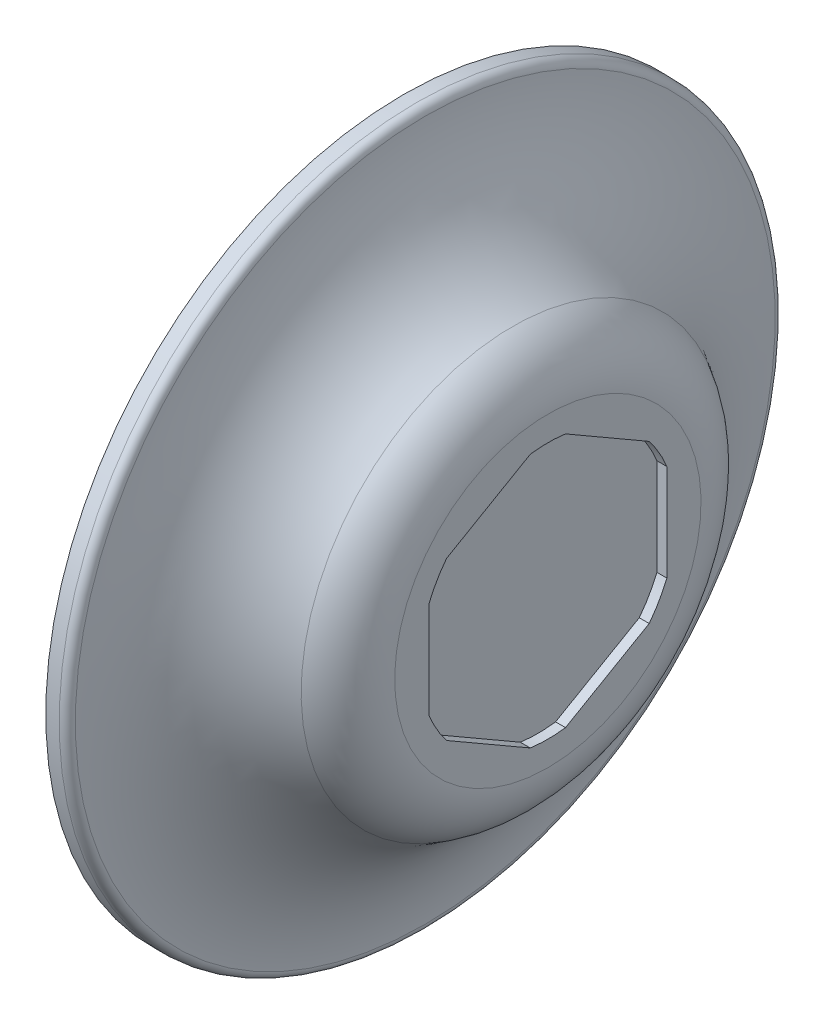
ISO-10303-21;
HEADER;
FILE_DESCRIPTION(('STEP AP214'),'2;1');
FILE_NAME('part.step','',(''),(''),'','','');
FILE_SCHEMA(('AUTOMOTIVE_DESIGN { 1 0 10303 214 1 1 1 1 }'));
ENDSEC;
DATA;
#1=APPLICATION_CONTEXT('core data for automotive mechanical design processes');
#2=APPLICATION_PROTOCOL_DEFINITION('international standard','automotive_design',2000,#1);
#3=PRODUCT_CONTEXT('',#1,'mechanical');
#4=PRODUCT('Part','Part','',(#3));
#5=PRODUCT_RELATED_PRODUCT_CATEGORY('part','',(#4));
#6=PRODUCT_DEFINITION_FORMATION('','',#4);
#7=PRODUCT_DEFINITION_CONTEXT('part definition',#1,'design');
#8=PRODUCT_DEFINITION('design','',#6,#7);
#9=PRODUCT_DEFINITION_SHAPE('','',#8);
#10=(LENGTH_UNIT() NAMED_UNIT(*) SI_UNIT(.MILLI.,.METRE.));
#11=(NAMED_UNIT(*) PLANE_ANGLE_UNIT() SI_UNIT($,.RADIAN.));
#12=(NAMED_UNIT(*) SI_UNIT($,.STERADIAN.) SOLID_ANGLE_UNIT());
#13=UNCERTAINTY_MEASURE_WITH_UNIT(LENGTH_MEASURE(1.E-05),#10,'distance_accuracy_value','');
#14=(GEOMETRIC_REPRESENTATION_CONTEXT(3) GLOBAL_UNCERTAINTY_ASSIGNED_CONTEXT((#13)) GLOBAL_UNIT_ASSIGNED_CONTEXT((#10,
#11,#12)) REPRESENTATION_CONTEXT('',''));
#15=CARTESIAN_POINT('',(0.,0.,0.));
#16=DIRECTION('',(0.,0.,1.));
#17=DIRECTION('',(1.,0.,0.));
#18=AXIS2_PLACEMENT_3D('',#15,#16,#17);
#19=CARTESIAN_POINT('',(6.94943478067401,0.,0.));
#20=DIRECTION('',(-1.,0.,0.));
#21=DIRECTION('',(0.,-1.,0.));
#22=AXIS2_PLACEMENT_3D('',#19,#20,#21);
#23=PLANE('',#22);
#24=CARTESIAN_POINT('',(6.94943478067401,0.,0.));
#25=DIRECTION('',(-1.,0.,0.));
#26=DIRECTION('',(0.,-1.,0.));
#27=AXIS2_PLACEMENT_3D('',#24,#25,#26);
#28=CIRCLE('',#27,12.2555);
#29=CARTESIAN_POINT('',(6.94943478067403,-12.2555,0.));
#30=VERTEX_POINT('',#29);
#31=EDGE_CURVE('E264',#30,#30,#28,.T.);
#32=ORIENTED_EDGE('',*,*,#31,.F.);
#33=EDGE_LOOP('',(#32));
#34=FACE_BOUND('',#33,.T.);
#35=CARTESIAN_POINT('',(6.94943478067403,0.,0.));
#36=DIRECTION('',(-1.,0.,0.));
#37=DIRECTION('',(0.,-1.,0.));
#38=AXIS2_PLACEMENT_3D('',#35,#36,#37);
#39=CIRCLE('',#38,15.5980272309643);
#40=CARTESIAN_POINT('',(6.94943478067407,-15.5980272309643,0.));
#41=VERTEX_POINT('',#40);
#42=EDGE_CURVE('E199',#41,#41,#39,.T.);
#43=ORIENTED_EDGE('',*,*,#42,.T.);
#44=EDGE_LOOP('',(#43));
#45=FACE_BOUND('',#44,.T.);
#46=ADVANCED_FACE('F28',(#34,#45),#23,.T.);
#47=CARTESIAN_POINT('',(9.413234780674,0.,0.));
#48=DIRECTION('',(-1.,0.,0.));
#49=DIRECTION('',(0.,-1.,0.));
#50=AXIS2_PLACEMENT_3D('',#47,#48,#49);
#51=PLANE('',#50);
#52=DIRECTION('',(0.,-0.500000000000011,-0.866025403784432));
#53=VECTOR('',#52,1.);
#54=CARTESIAN_POINT('',(9.41323478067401,-6.04451244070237,7.76779734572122));
#55=LINE('',#54,#53);
#56=CARTESIAN_POINT('',(9.41323478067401,-6.04451244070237,7.76779734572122));
#57=VERTEX_POINT('',#56);
#58=CARTESIAN_POINT('',(9.41323478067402,-9.74936605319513,1.35080265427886));
#59=VERTEX_POINT('',#58);
#60=EDGE_CURVE('E132',#57,#59,#55,.T.);
#61=ORIENTED_EDGE('',*,*,#60,.F.);
#62=CARTESIAN_POINT('',(9.413234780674,0.,0.));
#63=DIRECTION('',(1.,0.,0.));
#64=DIRECTION('',(0.,1.,0.));
#65=AXIS2_PLACEMENT_3D('',#62,#63,#64);
#66=CIRCLE('',#65,9.84249999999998);
#67=CARTESIAN_POINT('',(9.41323478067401,-3.70485361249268,9.1186));
#68=VERTEX_POINT('',#67);
#69=EDGE_CURVE('E42',#68,#57,#66,.T.);
#70=ORIENTED_EDGE('',*,*,#69,.F.);
#71=DIRECTION('',(0.,-1.,0.));
#72=VECTOR('',#71,1.);
#73=CARTESIAN_POINT('',(9.41323478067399,3.70485361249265,9.1186));
#74=LINE('',#73,#72);
#75=CARTESIAN_POINT('',(9.41323478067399,3.70485361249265,9.1186));
#76=VERTEX_POINT('',#75);
#77=EDGE_CURVE('E166',#76,#68,#74,.T.);
#78=ORIENTED_EDGE('',*,*,#77,.F.);
#79=CARTESIAN_POINT('',(9.413234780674,0.,0.));
#80=DIRECTION('',(1.,0.,0.));
#81=DIRECTION('',(0.,1.,0.));
#82=AXIS2_PLACEMENT_3D('',#79,#80,#81);
#83=CIRCLE('',#82,9.8425);
#84=CARTESIAN_POINT('',(9.41323478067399,6.04451244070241,7.76779734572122));
#85=VERTEX_POINT('',#84);
#86=EDGE_CURVE('E163',#85,#76,#83,.T.);
#87=ORIENTED_EDGE('',*,*,#86,.F.);
#88=DIRECTION('',(0.,0.499999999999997,-0.86602540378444));
#89=VECTOR('',#88,1.);
#90=CARTESIAN_POINT('',(9.41323478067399,6.04451244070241,7.76779734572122));
#91=LINE('',#90,#89);
#92=CARTESIAN_POINT('',(9.41323478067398,9.74936605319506,1.3508026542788));
#93=VERTEX_POINT('',#92);
#94=EDGE_CURVE('E160',#85,#93,#91,.T.);
#95=ORIENTED_EDGE('',*,*,#94,.T.);
#96=CARTESIAN_POINT('',(9.413234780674,0.,0.));
#97=DIRECTION('',(1.,0.,0.));
#98=DIRECTION('',(0.,1.,0.));
#99=AXIS2_PLACEMENT_3D('',#96,#97,#98);
#100=CIRCLE('',#99,9.84249999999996);
#101=CARTESIAN_POINT('',(9.41323478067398,9.74936605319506,-1.3508026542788));
#102=VERTEX_POINT('',#101);
#103=EDGE_CURVE('E157',#102,#93,#100,.T.);
#104=ORIENTED_EDGE('',*,*,#103,.F.);
#105=DIRECTION('',(0.,-0.499999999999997,-0.86602540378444));
#106=VECTOR('',#105,1.);
#107=CARTESIAN_POINT('',(9.41323478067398,9.74936605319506,-1.3508026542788));
#108=LINE('',#107,#106);
#109=CARTESIAN_POINT('',(9.41323478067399,6.04451244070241,-7.76779734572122));
#110=VERTEX_POINT('',#109);
#111=EDGE_CURVE('E154',#102,#110,#108,.T.);
#112=ORIENTED_EDGE('',*,*,#111,.T.);
#113=CARTESIAN_POINT('',(9.413234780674,0.,0.));
#114=DIRECTION('',(1.,0.,0.));
#115=DIRECTION('',(0.,1.,0.));
#116=AXIS2_PLACEMENT_3D('',#113,#114,#115);
#117=CIRCLE('',#116,9.8425);
#118=CARTESIAN_POINT('',(9.41323478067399,3.70485361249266,-9.1186));
#119=VERTEX_POINT('',#118);
#120=EDGE_CURVE('E151',#119,#110,#117,.T.);
#121=ORIENTED_EDGE('',*,*,#120,.F.);
#122=DIRECTION('',(0.,-1.,0.));
#123=VECTOR('',#122,1.);
#124=CARTESIAN_POINT('',(9.41323478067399,3.70485361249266,-9.1186));
#125=LINE('',#124,#123);
#126=CARTESIAN_POINT('',(9.41323478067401,-3.70485361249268,-9.11859999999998));
#127=VERTEX_POINT('',#126);
#128=EDGE_CURVE('E148',#119,#127,#125,.T.);
#129=ORIENTED_EDGE('',*,*,#128,.T.);
#130=CARTESIAN_POINT('',(9.413234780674,0.,0.));
#131=DIRECTION('',(1.,0.,0.));
#132=DIRECTION('',(0.,1.,0.));
#133=AXIS2_PLACEMENT_3D('',#130,#131,#132);
#134=CIRCLE('',#133,9.84249999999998);
#135=CARTESIAN_POINT('',(9.41323478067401,-6.04451244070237,-7.76779734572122));
#136=VERTEX_POINT('',#135);
#137=EDGE_CURVE('E142',#136,#127,#134,.T.);
#138=ORIENTED_EDGE('',*,*,#137,.F.);
#139=DIRECTION('',(0.,0.500000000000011,-0.866025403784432));
#140=VECTOR('',#139,1.);
#141=CARTESIAN_POINT('',(9.41323478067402,-9.74936605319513,-1.35080265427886));
#142=LINE('',#141,#140);
#143=CARTESIAN_POINT('',(9.41323478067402,-9.74936605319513,-1.35080265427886));
#144=VERTEX_POINT('',#143);
#145=EDGE_CURVE('E140',#144,#136,#142,.T.);
#146=ORIENTED_EDGE('',*,*,#145,.F.);
#147=CARTESIAN_POINT('',(9.413234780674,0.,0.));
#148=DIRECTION('',(1.,0.,0.));
#149=DIRECTION('',(0.,1.,0.));
#150=AXIS2_PLACEMENT_3D('',#147,#148,#149);
#151=CIRCLE('',#150,9.8425);
#152=EDGE_CURVE('E121',#59,#144,#151,.T.);
#153=ORIENTED_EDGE('',*,*,#152,.F.);
#154=EDGE_LOOP('',(#61,#70,#78,#87,#95,#104,#112,#121,#129,#138,#146,#153));
#155=FACE_BOUND('',#154,.T.);
#156=CARTESIAN_POINT('',(9.41323478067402,0.,0.));
#157=DIRECTION('',(-1.,0.,0.));
#158=DIRECTION('',(0.,-1.,0.));
#159=AXIS2_PLACEMENT_3D('',#156,#157,#158);
#160=CIRCLE('',#159,11.7436081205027);
#161=CARTESIAN_POINT('',(9.41323478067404,-11.7436081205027,0.));
#162=VERTEX_POINT('',#161);
#163=EDGE_CURVE('E232',#162,#162,#160,.T.);
#164=ORIENTED_EDGE('',*,*,#163,.F.);
#165=EDGE_LOOP('',(#164));
#166=FACE_BOUND('',#165,.T.);
#167=ADVANCED_FACE('F136',(#155,#166),#51,.F.);
#168=CARTESIAN_POINT('',(4.33323478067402,0.,0.));
#169=DIRECTION('',(-1.,0.,0.));
#170=DIRECTION('',(0.,-1.,0.));
#171=AXIS2_PLACEMENT_3D('',#168,#169,#170);
#172=TOROIDAL_SURFACE('',#171,11.7436081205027,5.08);
#173=CARTESIAN_POINT('',(6.7237391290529,0.,0.));
#174=DIRECTION('',(-1.,0.,0.));
#175=DIRECTION('',(0.,-1.,0.));
#176=AXIS2_PLACEMENT_3D('',#173,#174,#175);
#177=CIRCLE('',#176,16.2260058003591);
#178=CARTESIAN_POINT('',(6.72373912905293,-16.2260058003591,0.));
#179=VERTEX_POINT('',#178);
#180=EDGE_CURVE('E229',#179,#179,#177,.T.);
#181=ORIENTED_EDGE('',*,*,#180,.F.);
#182=EDGE_LOOP('',(#181));
#183=FACE_BOUND('',#182,.T.);
#184=ORIENTED_EDGE('',*,*,#163,.T.);
#185=EDGE_LOOP('',(#184));
#186=FACE_BOUND('',#185,.T.);
#187=ADVANCED_FACE('F260',(#183,#186),#172,.T.);
#188=CARTESIAN_POINT('',(12.7000000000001,0.,0.));
#189=DIRECTION('',(-1.,0.,0.));
#190=DIRECTION('',(0.,-1.,0.));
#191=AXIS2_PLACEMENT_3D('',#188,#189,#190);
#192=TOROIDAL_SURFACE('',#191,27.432,12.7);
#193=CARTESIAN_POINT('',(0.0144072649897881,0.,0.));
#194=DIRECTION('',(1.,0.,0.));
#195=DIRECTION('',(0.,1.,0.));
#196=AXIS2_PLACEMENT_3D('',#193,#194,#195);
#197=CIRCLE('',#196,26.8272380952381);
#198=CARTESIAN_POINT('',(0.0144072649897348,26.8272380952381,0.));
#199=VERTEX_POINT('',#198);
#200=EDGE_CURVE('E11',#199,#199,#197,.T.);
#201=ORIENTED_EDGE('',*,*,#200,.T.);
#202=EDGE_LOOP('',(#201));
#203=FACE_BOUND('',#202,.T.);
#204=ORIENTED_EDGE('',*,*,#180,.T.);
#205=EDGE_LOOP('',(#204));
#206=FACE_BOUND('',#205,.T.);
#207=ADVANCED_FACE('F285',(#203,#206),#192,.F.);
#208=CARTESIAN_POINT('',(6.94943478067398,0.,0.));
#209=DIRECTION('',(-1.,0.,0.));
#210=DIRECTION('',(0.,-1.,0.));
#211=AXIS2_PLACEMENT_3D('',#208,#209,#210);
#212=CYLINDRICAL_SURFACE('',#211,27.432);
#213=CARTESIAN_POINT('',(-0.619872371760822,0.,0.));
#214=DIRECTION('',(1.,0.,0.));
#215=DIRECTION('',(0.,1.,0.));
#216=AXIS2_PLACEMENT_3D('',#213,#214,#215);
#217=CIRCLE('',#216,27.432);
#218=CARTESIAN_POINT('',(-0.619872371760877,27.432,0.));
#219=VERTEX_POINT('',#218);
#220=EDGE_CURVE('E35',#219,#219,#217,.F.);
#221=ORIENTED_EDGE('',*,*,#220,.T.);
#222=EDGE_LOOP('',(#221));
#223=FACE_BOUND('',#222,.T.);
#224=CARTESIAN_POINT('',(-1.6509999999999,0.,0.));
#225=DIRECTION('',(-1.,0.,0.));
#226=DIRECTION('',(0.,-1.,0.));
#227=AXIS2_PLACEMENT_3D('',#224,#225,#226);
#228=CIRCLE('',#227,27.432);
#229=CARTESIAN_POINT('',(-1.65099999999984,-27.4320000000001,0.));
#230=VERTEX_POINT('',#229);
#231=EDGE_CURVE('E226',#230,#230,#228,.T.);
#232=ORIENTED_EDGE('',*,*,#231,.F.);
#233=EDGE_LOOP('',(#232));
#234=FACE_BOUND('',#233,.T.);
#235=ADVANCED_FACE('F237',(#223,#234),#212,.T.);
#236=CARTESIAN_POINT('',(-1.65099999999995,27.432,0.));
#237=DIRECTION('',(1.,0.,0.));
#238=DIRECTION('',(0.,1.,0.));
#239=AXIS2_PLACEMENT_3D('',#236,#237,#238);
#240=PLANE('',#239);
#241=CARTESIAN_POINT('',(-1.6509999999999,0.,0.));
#242=DIRECTION('',(-1.,0.,0.));
#243=DIRECTION('',(0.,-1.,0.));
#244=AXIS2_PLACEMENT_3D('',#241,#242,#243);
#245=CIRCLE('',#244,26.162);
#246=CARTESIAN_POINT('',(-1.65099999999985,-26.1620000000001,0.));
#247=VERTEX_POINT('',#246);
#248=EDGE_CURVE('E223',#247,#247,#245,.T.);
#249=ORIENTED_EDGE('',*,*,#248,.F.);
#250=EDGE_LOOP('',(#249));
#251=FACE_BOUND('',#250,.T.);
#252=ORIENTED_EDGE('',*,*,#231,.T.);
#253=EDGE_LOOP('',(#252));
#254=FACE_BOUND('',#253,.T.);
#255=ADVANCED_FACE('F277',(#251,#254),#240,.F.);
#256=CARTESIAN_POINT('',(6.94943478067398,0.,0.));
#257=DIRECTION('',(-1.,0.,0.));
#258=DIRECTION('',(0.,-1.,0.));
#259=AXIS2_PLACEMENT_3D('',#256,#257,#258);
#260=CYLINDRICAL_SURFACE('',#259,26.162);
#261=CARTESIAN_POINT('',(-0.395763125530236,0.,0.));
#262=DIRECTION('',(-1.,0.,0.));
#263=DIRECTION('',(0.,-1.,0.));
#264=AXIS2_PLACEMENT_3D('',#261,#262,#263);
#265=CIRCLE('',#264,26.162);
#266=CARTESIAN_POINT('',(-0.395763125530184,-26.1620000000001,0.));
#267=VERTEX_POINT('',#266);
#268=EDGE_CURVE('E220',#267,#267,#265,.T.);
#269=ORIENTED_EDGE('',*,*,#268,.F.);
#270=EDGE_LOOP('',(#269));
#271=FACE_BOUND('',#270,.T.);
#272=ORIENTED_EDGE('',*,*,#248,.T.);
#273=EDGE_LOOP('',(#272));
#274=FACE_BOUND('',#273,.T.);
#275=ADVANCED_FACE('F271',(#271,#274),#260,.F.);
#276=CARTESIAN_POINT('',(12.7000000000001,0.,0.));
#277=DIRECTION('',(-1.,0.,0.));
#278=DIRECTION('',(0.,-1.,0.));
#279=AXIS2_PLACEMENT_3D('',#276,#277,#278);
#280=TOROIDAL_SURFACE('',#279,27.432,13.1572);
#281=ORIENTED_EDGE('',*,*,#42,.F.);
#282=EDGE_LOOP('',(#281));
#283=FACE_BOUND('',#282,.T.);
#284=ORIENTED_EDGE('',*,*,#268,.T.);
#285=EDGE_LOOP('',(#284));
#286=FACE_BOUND('',#285,.T.);
#287=ADVANCED_FACE('F267',(#283,#286),#280,.T.);
#288=CARTESIAN_POINT('',(8.651234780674,0.,0.));
#289=DIRECTION('',(1.,0.,0.));
#290=DIRECTION('',(0.,1.,0.));
#291=AXIS2_PLACEMENT_3D('',#288,#289,#290);
#292=CYLINDRICAL_SURFACE('',#291,9.84249999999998);
#293=ORIENTED_EDGE('',*,*,#69,.T.);
#294=DIRECTION('',(1.,0.,0.));
#295=VECTOR('',#294,1.);
#296=CARTESIAN_POINT('',(8.65123478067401,-6.04451244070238,7.76779734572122));
#297=LINE('',#296,#295);
#298=CARTESIAN_POINT('',(8.65123478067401,-6.04451244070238,7.76779734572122));
#299=VERTEX_POINT('',#298);
#300=EDGE_CURVE('E129',#299,#57,#297,.T.);
#301=ORIENTED_EDGE('',*,*,#300,.F.);
#302=CARTESIAN_POINT('',(8.651234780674,0.,0.));
#303=DIRECTION('',(1.,0.,0.));
#304=DIRECTION('',(0.,1.,0.));
#305=AXIS2_PLACEMENT_3D('',#302,#303,#304);
#306=CIRCLE('',#305,9.84249999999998);
#307=CARTESIAN_POINT('',(8.65123478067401,-3.70485361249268,9.1186));
#308=VERTEX_POINT('',#307);
#309=EDGE_CURVE('E168',#308,#299,#306,.T.);
#310=ORIENTED_EDGE('',*,*,#309,.F.);
#311=DIRECTION('',(1.,0.,0.));
#312=VECTOR('',#311,1.);
#313=CARTESIAN_POINT('',(8.65123478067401,-3.70485361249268,9.1186));
#314=LINE('',#313,#312);
#315=EDGE_CURVE('E49',#308,#68,#314,.T.);
#316=ORIENTED_EDGE('',*,*,#315,.T.);
#317=EDGE_LOOP('',(#293,#301,#310,#316));
#318=FACE_BOUND('',#317,.T.);
#319=ADVANCED_FACE('F270',(#318),#292,.F.);
#320=CARTESIAN_POINT('',(8.65123478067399,3.70485361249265,9.1186));
#321=DIRECTION('',(0.,0.,1.));
#322=DIRECTION('',(1.,0.,0.));
#323=AXIS2_PLACEMENT_3D('',#320,#321,#322);
#324=PLANE('',#323);
#325=ORIENTED_EDGE('',*,*,#77,.T.);
#326=ORIENTED_EDGE('',*,*,#315,.F.);
#327=DIRECTION('',(0.,-1.,0.));
#328=VECTOR('',#327,1.);
#329=CARTESIAN_POINT('',(8.65123478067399,3.70485361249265,9.1186));
#330=LINE('',#329,#328);
#331=CARTESIAN_POINT('',(8.65123478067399,3.70485361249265,9.1186));
#332=VERTEX_POINT('',#331);
#333=EDGE_CURVE('E195',#332,#308,#330,.T.);
#334=ORIENTED_EDGE('',*,*,#333,.F.);
#335=DIRECTION('',(1.,0.,0.));
#336=VECTOR('',#335,1.);
#337=CARTESIAN_POINT('',(8.65123478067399,3.70485361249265,9.1186));
#338=LINE('',#337,#336);
#339=EDGE_CURVE('E200',#332,#76,#338,.T.);
#340=ORIENTED_EDGE('',*,*,#339,.T.);
#341=EDGE_LOOP('',(#325,#326,#334,#340));
#342=FACE_BOUND('',#341,.T.);
#343=ADVANCED_FACE('F324',(#342),#324,.F.);
#344=CARTESIAN_POINT('',(8.651234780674,0.,0.));
#345=DIRECTION('',(1.,0.,0.));
#346=DIRECTION('',(0.,1.,0.));
#347=AXIS2_PLACEMENT_3D('',#344,#345,#346);
#348=CYLINDRICAL_SURFACE('',#347,9.8425);
#349=ORIENTED_EDGE('',*,*,#86,.T.);
#350=ORIENTED_EDGE('',*,*,#339,.F.);
#351=CARTESIAN_POINT('',(8.651234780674,0.,0.));
#352=DIRECTION('',(1.,0.,0.));
#353=DIRECTION('',(0.,1.,0.));
#354=AXIS2_PLACEMENT_3D('',#351,#352,#353);
#355=CIRCLE('',#354,9.8425);
#356=CARTESIAN_POINT('',(8.65123478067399,6.04451244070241,7.76779734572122));
#357=VERTEX_POINT('',#356);
#358=EDGE_CURVE('E192',#357,#332,#355,.T.);
#359=ORIENTED_EDGE('',*,*,#358,.F.);
#360=DIRECTION('',(1.,0.,0.));
#361=VECTOR('',#360,1.);
#362=CARTESIAN_POINT('',(8.65123478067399,6.04451244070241,7.76779734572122));
#363=LINE('',#362,#361);
#364=EDGE_CURVE('E202',#357,#85,#363,.T.);
#365=ORIENTED_EDGE('',*,*,#364,.T.);
#366=EDGE_LOOP('',(#349,#350,#359,#365));
#367=FACE_BOUND('',#366,.T.);
#368=ADVANCED_FACE('F331',(#367),#348,.F.);
#369=CARTESIAN_POINT('',(8.65123478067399,6.04451244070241,7.76779734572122));
#370=DIRECTION('',(0.,-0.86602540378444,-0.499999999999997));
#371=DIRECTION('',(0.,0.499999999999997,-0.86602540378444));
#372=AXIS2_PLACEMENT_3D('',#369,#370,#371);
#373=PLANE('',#372);
#374=ORIENTED_EDGE('',*,*,#94,.F.);
#375=ORIENTED_EDGE('',*,*,#364,.F.);
#376=DIRECTION('',(0.,0.499999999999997,-0.86602540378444));
#377=VECTOR('',#376,1.);
#378=CARTESIAN_POINT('',(8.65123478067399,6.04451244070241,7.76779734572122));
#379=LINE('',#378,#377);
#380=CARTESIAN_POINT('',(8.65123478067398,9.74936605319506,1.3508026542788));
#381=VERTEX_POINT('',#380);
#382=EDGE_CURVE('E190',#357,#381,#379,.T.);
#383=ORIENTED_EDGE('',*,*,#382,.T.);
#384=DIRECTION('',(1.,0.,0.));
#385=VECTOR('',#384,1.);
#386=CARTESIAN_POINT('',(8.65123478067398,9.74936605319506,1.3508026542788));
#387=LINE('',#386,#385);
#388=EDGE_CURVE('E204',#381,#93,#387,.T.);
#389=ORIENTED_EDGE('',*,*,#388,.T.);
#390=EDGE_LOOP('',(#374,#375,#383,#389));
#391=FACE_BOUND('',#390,.T.);
#392=ADVANCED_FACE('F338',(#391),#373,.T.);
#393=CARTESIAN_POINT('',(8.651234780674,0.,0.));
#394=DIRECTION('',(1.,0.,0.));
#395=DIRECTION('',(0.,1.,0.));
#396=AXIS2_PLACEMENT_3D('',#393,#394,#395);
#397=CYLINDRICAL_SURFACE('',#396,9.84249999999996);
#398=ORIENTED_EDGE('',*,*,#103,.T.);
#399=ORIENTED_EDGE('',*,*,#388,.F.);
#400=CARTESIAN_POINT('',(8.651234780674,0.,0.));
#401=DIRECTION('',(1.,0.,0.));
#402=DIRECTION('',(0.,1.,0.));
#403=AXIS2_PLACEMENT_3D('',#400,#401,#402);
#404=CIRCLE('',#403,9.84249999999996);
#405=CARTESIAN_POINT('',(8.65123478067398,9.74936605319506,-1.3508026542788));
#406=VERTEX_POINT('',#405);
#407=EDGE_CURVE('E187',#406,#381,#404,.T.);
#408=ORIENTED_EDGE('',*,*,#407,.F.);
#409=DIRECTION('',(1.,0.,0.));
#410=VECTOR('',#409,1.);
#411=CARTESIAN_POINT('',(8.65123478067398,9.74936605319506,-1.3508026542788));
#412=LINE('',#411,#410);
#413=EDGE_CURVE('E206',#406,#102,#412,.T.);
#414=ORIENTED_EDGE('',*,*,#413,.T.);
#415=EDGE_LOOP('',(#398,#399,#408,#414));
#416=FACE_BOUND('',#415,.T.);
#417=ADVANCED_FACE('F346',(#416),#397,.F.);
#418=CARTESIAN_POINT('',(8.65123478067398,9.74936605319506,-1.3508026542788));
#419=DIRECTION('',(0.,-0.86602540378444,0.499999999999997));
#420=DIRECTION('',(0.,-0.499999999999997,-0.86602540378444));
#421=AXIS2_PLACEMENT_3D('',#418,#419,#420);
#422=PLANE('',#421);
#423=ORIENTED_EDGE('',*,*,#111,.F.);
#424=ORIENTED_EDGE('',*,*,#413,.F.);
#425=DIRECTION('',(0.,-0.499999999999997,-0.86602540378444));
#426=VECTOR('',#425,1.);
#427=CARTESIAN_POINT('',(8.65123478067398,9.74936605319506,-1.3508026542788));
#428=LINE('',#427,#426);
#429=CARTESIAN_POINT('',(8.65123478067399,6.04451244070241,-7.76779734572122));
#430=VERTEX_POINT('',#429);
#431=EDGE_CURVE('E185',#406,#430,#428,.T.);
#432=ORIENTED_EDGE('',*,*,#431,.T.);
#433=DIRECTION('',(1.,0.,0.));
#434=VECTOR('',#433,1.);
#435=CARTESIAN_POINT('',(8.65123478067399,6.04451244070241,-7.76779734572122));
#436=LINE('',#435,#434);
#437=EDGE_CURVE('E208',#430,#110,#436,.T.);
#438=ORIENTED_EDGE('',*,*,#437,.T.);
#439=EDGE_LOOP('',(#423,#424,#432,#438));
#440=FACE_BOUND('',#439,.T.);
#441=ADVANCED_FACE('F354',(#440),#422,.T.);
#442=CARTESIAN_POINT('',(8.651234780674,0.,0.));
#443=DIRECTION('',(1.,0.,0.));
#444=DIRECTION('',(0.,1.,0.));
#445=AXIS2_PLACEMENT_3D('',#442,#443,#444);
#446=CYLINDRICAL_SURFACE('',#445,9.8425);
#447=ORIENTED_EDGE('',*,*,#120,.T.);
#448=ORIENTED_EDGE('',*,*,#437,.F.);
#449=CARTESIAN_POINT('',(8.651234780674,0.,0.));
#450=DIRECTION('',(1.,0.,0.));
#451=DIRECTION('',(0.,1.,0.));
#452=AXIS2_PLACEMENT_3D('',#449,#450,#451);
#453=CIRCLE('',#452,9.8425);
#454=CARTESIAN_POINT('',(8.65123478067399,3.70485361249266,-9.1186));
#455=VERTEX_POINT('',#454);
#456=EDGE_CURVE('E182',#455,#430,#453,.T.);
#457=ORIENTED_EDGE('',*,*,#456,.F.);
#458=DIRECTION('',(1.,0.,0.));
#459=VECTOR('',#458,1.);
#460=CARTESIAN_POINT('',(8.65123478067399,3.70485361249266,-9.1186));
#461=LINE('',#460,#459);
#462=EDGE_CURVE('E210',#455,#119,#461,.T.);
#463=ORIENTED_EDGE('',*,*,#462,.T.);
#464=EDGE_LOOP('',(#447,#448,#457,#463));
#465=FACE_BOUND('',#464,.T.);
#466=ADVANCED_FACE('F362',(#465),#446,.F.);
#467=CARTESIAN_POINT('',(8.65123478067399,3.70485361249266,-9.1186));
#468=DIRECTION('',(0.,0.,1.));
#469=DIRECTION('',(1.,0.,0.));
#470=AXIS2_PLACEMENT_3D('',#467,#468,#469);
#471=PLANE('',#470);
#472=ORIENTED_EDGE('',*,*,#128,.F.);
#473=ORIENTED_EDGE('',*,*,#462,.F.);
#474=DIRECTION('',(0.,-1.,0.));
#475=VECTOR('',#474,1.);
#476=CARTESIAN_POINT('',(8.65123478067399,3.70485361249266,-9.1186));
#477=LINE('',#476,#475);
#478=CARTESIAN_POINT('',(8.65123478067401,-3.70485361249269,-9.11859999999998));
#479=VERTEX_POINT('',#478);
#480=EDGE_CURVE('E180',#455,#479,#477,.T.);
#481=ORIENTED_EDGE('',*,*,#480,.T.);
#482=DIRECTION('',(1.,0.,0.));
#483=VECTOR('',#482,1.);
#484=CARTESIAN_POINT('',(8.65123478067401,-3.70485361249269,-9.11859999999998));
#485=LINE('',#484,#483);
#486=EDGE_CURVE('E212',#479,#127,#485,.T.);
#487=ORIENTED_EDGE('',*,*,#486,.T.);
#488=EDGE_LOOP('',(#472,#473,#481,#487));
#489=FACE_BOUND('',#488,.T.);
#490=ADVANCED_FACE('F370',(#489),#471,.T.);
#491=CARTESIAN_POINT('',(8.651234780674,0.,0.));
#492=DIRECTION('',(1.,0.,0.));
#493=DIRECTION('',(0.,1.,0.));
#494=AXIS2_PLACEMENT_3D('',#491,#492,#493);
#495=CYLINDRICAL_SURFACE('',#494,9.84249999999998);
#496=ORIENTED_EDGE('',*,*,#137,.T.);
#497=ORIENTED_EDGE('',*,*,#486,.F.);
#498=CARTESIAN_POINT('',(8.651234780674,0.,0.));
#499=DIRECTION('',(1.,0.,0.));
#500=DIRECTION('',(0.,1.,0.));
#501=AXIS2_PLACEMENT_3D('',#498,#499,#500);
#502=CIRCLE('',#501,9.84249999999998);
#503=CARTESIAN_POINT('',(8.65123478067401,-6.04451244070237,-7.76779734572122));
#504=VERTEX_POINT('',#503);
#505=EDGE_CURVE('E177',#504,#479,#502,.T.);
#506=ORIENTED_EDGE('',*,*,#505,.F.);
#507=DIRECTION('',(1.,0.,0.));
#508=VECTOR('',#507,1.);
#509=CARTESIAN_POINT('',(8.65123478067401,-6.04451244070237,-7.76779734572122));
#510=LINE('',#509,#508);
#511=EDGE_CURVE('E214',#504,#136,#510,.T.);
#512=ORIENTED_EDGE('',*,*,#511,.T.);
#513=EDGE_LOOP('',(#496,#497,#506,#512));
#514=FACE_BOUND('',#513,.T.);
#515=ADVANCED_FACE('F378',(#514),#495,.F.);
#516=CARTESIAN_POINT('',(8.65123478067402,-9.74936605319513,-1.35080265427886));
#517=DIRECTION('',(0.,-0.866025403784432,-0.500000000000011));
#518=DIRECTION('',(0.,0.500000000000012,-0.866025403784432));
#519=AXIS2_PLACEMENT_3D('',#516,#517,#518);
#520=PLANE('',#519);
#521=ORIENTED_EDGE('',*,*,#145,.T.);
#522=ORIENTED_EDGE('',*,*,#511,.F.);
#523=DIRECTION('',(0.,0.500000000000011,-0.866025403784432));
#524=VECTOR('',#523,1.);
#525=CARTESIAN_POINT('',(8.65123478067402,-9.74936605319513,-1.35080265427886));
#526=LINE('',#525,#524);
#527=CARTESIAN_POINT('',(8.65123478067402,-9.74936605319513,-1.35080265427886));
#528=VERTEX_POINT('',#527);
#529=EDGE_CURVE('E174',#528,#504,#526,.T.);
#530=ORIENTED_EDGE('',*,*,#529,.F.);
#531=DIRECTION('',(1.,0.,0.));
#532=VECTOR('',#531,1.);
#533=CARTESIAN_POINT('',(8.65123478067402,-9.74936605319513,-1.35080265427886));
#534=LINE('',#533,#532);
#535=EDGE_CURVE('E128',#528,#144,#534,.T.);
#536=ORIENTED_EDGE('',*,*,#535,.T.);
#537=EDGE_LOOP('',(#521,#522,#530,#536));
#538=FACE_BOUND('',#537,.T.);
#539=ADVANCED_FACE('F386',(#538),#520,.F.);
#540=CARTESIAN_POINT('',(8.651234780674,0.,0.));
#541=DIRECTION('',(1.,0.,0.));
#542=DIRECTION('',(0.,1.,0.));
#543=AXIS2_PLACEMENT_3D('',#540,#541,#542);
#544=CYLINDRICAL_SURFACE('',#543,9.8425);
#545=ORIENTED_EDGE('',*,*,#152,.T.);
#546=ORIENTED_EDGE('',*,*,#535,.F.);
#547=CARTESIAN_POINT('',(8.651234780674,0.,0.));
#548=DIRECTION('',(1.,0.,0.));
#549=DIRECTION('',(0.,1.,0.));
#550=AXIS2_PLACEMENT_3D('',#547,#548,#549);
#551=CIRCLE('',#550,9.8425);
#552=CARTESIAN_POINT('',(8.65123478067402,-9.74936605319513,1.35080265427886));
#553=VERTEX_POINT('',#552);
#554=EDGE_CURVE('E124',#553,#528,#551,.T.);
#555=ORIENTED_EDGE('',*,*,#554,.F.);
#556=DIRECTION('',(1.,0.,0.));
#557=VECTOR('',#556,1.);
#558=CARTESIAN_POINT('',(8.65123478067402,-9.74936605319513,1.35080265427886));
#559=LINE('',#558,#557);
#560=EDGE_CURVE('E117',#553,#59,#559,.T.);
#561=ORIENTED_EDGE('',*,*,#560,.T.);
#562=EDGE_LOOP('',(#545,#546,#555,#561));
#563=FACE_BOUND('',#562,.T.);
#564=ADVANCED_FACE('F119',(#563),#544,.F.);
#565=CARTESIAN_POINT('',(8.65123478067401,-6.04451244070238,7.76779734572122));
#566=DIRECTION('',(0.,-0.866025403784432,0.500000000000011));
#567=DIRECTION('',(0.,-0.500000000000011,-0.866025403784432));
#568=AXIS2_PLACEMENT_3D('',#565,#566,#567);
#569=PLANE('',#568);
#570=ORIENTED_EDGE('',*,*,#60,.T.);
#571=ORIENTED_EDGE('',*,*,#560,.F.);
#572=DIRECTION('',(0.,-0.500000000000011,-0.866025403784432));
#573=VECTOR('',#572,1.);
#574=CARTESIAN_POINT('',(8.65123478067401,-6.04451244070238,7.76779734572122));
#575=LINE('',#574,#573);
#576=EDGE_CURVE('E171',#299,#553,#575,.T.);
#577=ORIENTED_EDGE('',*,*,#576,.F.);
#578=ORIENTED_EDGE('',*,*,#300,.T.);
#579=EDGE_LOOP('',(#570,#571,#577,#578));
#580=FACE_BOUND('',#579,.T.);
#581=ADVANCED_FACE('F133',(#580),#569,.F.);
#582=CARTESIAN_POINT('',(8.651234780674,0.,0.));
#583=DIRECTION('',(1.,0.,0.));
#584=DIRECTION('',(0.,1.,0.));
#585=AXIS2_PLACEMENT_3D('',#582,#583,#584);
#586=PLANE('',#585);
#587=ORIENTED_EDGE('',*,*,#309,.T.);
#588=ORIENTED_EDGE('',*,*,#576,.T.);
#589=ORIENTED_EDGE('',*,*,#554,.T.);
#590=ORIENTED_EDGE('',*,*,#529,.T.);
#591=ORIENTED_EDGE('',*,*,#505,.T.);
#592=ORIENTED_EDGE('',*,*,#480,.F.);
#593=ORIENTED_EDGE('',*,*,#456,.T.);
#594=ORIENTED_EDGE('',*,*,#431,.F.);
#595=ORIENTED_EDGE('',*,*,#407,.T.);
#596=ORIENTED_EDGE('',*,*,#382,.F.);
#597=ORIENTED_EDGE('',*,*,#358,.T.);
#598=ORIENTED_EDGE('',*,*,#333,.T.);
#599=EDGE_LOOP('',(#587,#588,#589,#590,#591,#592,#593,#594,#595,#596,#597,#598));
#600=FACE_BOUND('',#599,.T.);
#601=ADVANCED_FACE('F406',(#600),#586,.T.);
#602=CARTESIAN_POINT('',(7.69873478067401,0.,0.));
#603=DIRECTION('',(-1.,0.,0.));
#604=DIRECTION('',(0.,-1.,0.));
#605=AXIS2_PLACEMENT_3D('',#602,#603,#604);
#606=CYLINDRICAL_SURFACE('',#605,12.2555);
#607=CARTESIAN_POINT('',(7.69873478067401,0.,0.));
#608=DIRECTION('',(-1.,0.,0.));
#609=DIRECTION('',(0.,-1.,0.));
#610=AXIS2_PLACEMENT_3D('',#607,#608,#609);
#611=CIRCLE('',#610,12.2555);
#612=CARTESIAN_POINT('',(7.69873478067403,-12.2555,0.));
#613=VERTEX_POINT('',#612);
#614=EDGE_CURVE('E436',#613,#613,#611,.T.);
#615=CARTESIAN_POINT('',(7.69873478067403,-12.2555,0.));
#616=CARTESIAN_POINT('',(7.6909295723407,-12.2555,0.));
#617=CARTESIAN_POINT('',(7.68312436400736,-12.2555,0.));
#618=CARTESIAN_POINT('',(7.6675139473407,-12.2555,0.));
#619=CARTESIAN_POINT('',(7.65970873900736,-12.2555,0.));
#620=CARTESIAN_POINT('',(7.6440983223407,-12.2555,0.));
#621=CARTESIAN_POINT('',(7.63629311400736,-12.2555,0.));
#622=CARTESIAN_POINT('',(7.6206826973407,-12.2555,0.));
#623=CARTESIAN_POINT('',(7.61287748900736,-12.2555,0.));
#624=CARTESIAN_POINT('',(7.5972670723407,-12.2555,0.));
#625=CARTESIAN_POINT('',(7.58946186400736,-12.2555,0.));
#626=CARTESIAN_POINT('',(7.5738514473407,-12.2555,0.));
#627=CARTESIAN_POINT('',(7.56604623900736,-12.2555,0.));
#628=CARTESIAN_POINT('',(7.5504358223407,-12.2555,0.));
#629=CARTESIAN_POINT('',(7.54263061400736,-12.2555,0.));
#630=CARTESIAN_POINT('',(7.5270201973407,-12.2555,0.));
#631=CARTESIAN_POINT('',(7.51921498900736,-12.2555,0.));
#632=CARTESIAN_POINT('',(7.5036045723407,-12.2555,0.));
#633=CARTESIAN_POINT('',(7.49579936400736,-12.2555,0.));
#634=CARTESIAN_POINT('',(7.4801889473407,-12.2555,0.));
#635=CARTESIAN_POINT('',(7.47238373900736,-12.2555,0.));
#636=CARTESIAN_POINT('',(7.4567733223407,-12.2555,0.));
#637=CARTESIAN_POINT('',(7.44896811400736,-12.2555,0.));
#638=CARTESIAN_POINT('',(7.4333576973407,-12.2555,0.));
#639=CARTESIAN_POINT('',(7.42555248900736,-12.2555,0.));
#640=CARTESIAN_POINT('',(7.4099420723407,-12.2555,0.));
#641=CARTESIAN_POINT('',(7.40213686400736,-12.2555,0.));
#642=CARTESIAN_POINT('',(7.3865264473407,-12.2555,0.));
#643=CARTESIAN_POINT('',(7.37872123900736,-12.2555,0.));
#644=CARTESIAN_POINT('',(7.3631108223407,-12.2555,0.));
#645=CARTESIAN_POINT('',(7.35530561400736,-12.2555,0.));
#646=CARTESIAN_POINT('',(7.3396951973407,-12.2555,0.));
#647=CARTESIAN_POINT('',(7.33188998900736,-12.2555,0.));
#648=CARTESIAN_POINT('',(7.3162795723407,-12.2555,0.));
#649=CARTESIAN_POINT('',(7.30847436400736,-12.2555,0.));
#650=CARTESIAN_POINT('',(7.2928639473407,-12.2555,0.));
#651=CARTESIAN_POINT('',(7.28505873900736,-12.2555,0.));
#652=CARTESIAN_POINT('',(7.2694483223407,-12.2555,0.));
#653=CARTESIAN_POINT('',(7.26164311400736,-12.2555,0.));
#654=CARTESIAN_POINT('',(7.2460326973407,-12.2555,0.));
#655=CARTESIAN_POINT('',(7.23822748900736,-12.2555,0.));
#656=CARTESIAN_POINT('',(7.2226170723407,-12.2555,0.));
#657=CARTESIAN_POINT('',(7.21481186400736,-12.2555,0.));
#658=CARTESIAN_POINT('',(7.1992014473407,-12.2555,0.));
#659=CARTESIAN_POINT('',(7.19139623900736,-12.2555,0.));
#660=CARTESIAN_POINT('',(7.1757858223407,-12.2555,0.));
#661=CARTESIAN_POINT('',(7.16798061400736,-12.2555,0.));
#662=CARTESIAN_POINT('',(7.1523701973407,-12.2555,0.));
#663=CARTESIAN_POINT('',(7.14456498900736,-12.2555,0.));
#664=CARTESIAN_POINT('',(7.1289545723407,-12.2555,0.));
#665=CARTESIAN_POINT('',(7.12114936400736,-12.2555,0.));
#666=CARTESIAN_POINT('',(7.1055389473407,-12.2555,0.));
#667=CARTESIAN_POINT('',(7.09773373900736,-12.2555,0.));
#668=CARTESIAN_POINT('',(7.0821233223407,-12.2555,0.));
#669=CARTESIAN_POINT('',(7.07431811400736,-12.2555,0.));
#670=CARTESIAN_POINT('',(7.0587076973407,-12.2555,0.));
#671=CARTESIAN_POINT('',(7.05090248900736,-12.2555,0.));
#672=CARTESIAN_POINT('',(7.0352920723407,-12.2555,0.));
#673=CARTESIAN_POINT('',(7.02748686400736,-12.2555,0.));
#674=CARTESIAN_POINT('',(7.0118764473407,-12.2555,0.));
#675=CARTESIAN_POINT('',(7.00407123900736,-12.2555,0.));
#676=CARTESIAN_POINT('',(6.9884608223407,-12.2555,0.));
#677=CARTESIAN_POINT('',(6.98065561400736,-12.2555,0.));
#678=CARTESIAN_POINT('',(6.9650451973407,-12.2555,0.));
#679=CARTESIAN_POINT('',(6.95723998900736,-12.2555,0.));
#680=CARTESIAN_POINT('',(6.94943478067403,-12.2555,0.));
#681=B_SPLINE_CURVE_WITH_KNOTS('',3,(#615,#616,#617,#618,#619,#620,#621,#622,#623,#624,#625,
#626,#627,#628,#629,#630,#631,#632,#633,#634,#635,#636,#637,#638,#639,#640,#641,#642,#643,#644,
#645,#646,#647,#648,#649,#650,#651,#652,#653,#654,#655,#656,#657,#658,#659,#660,#661,#662,#663,
#664,#665,#666,#667,#668,#669,#670,#671,#672,#673,#674,#675,#676,#677,#678,#679,#680),
.UNSPECIFIED.,.F.,.F.,(4,2,2,2,2,2,2,2,2,2,2,2,2,2,2,2,2,2,2,2,2,2,2,2,2,2,2,2,2,2,2,2,4),(0.,
0.0234156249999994,0.0468312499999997,0.0702468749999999,0.0936624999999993,0.117078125,
0.14049375,0.163909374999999,0.187324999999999,0.210740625,0.234156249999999,0.257571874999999,
0.2809875,0.304403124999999,0.327818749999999,0.351234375,0.374649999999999,0.398065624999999,
0.421481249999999,0.444896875,0.468312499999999,0.491728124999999,0.515143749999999,
0.538559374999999,0.561974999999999,0.585390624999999,0.608806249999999,0.632221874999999,
0.655637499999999,0.679053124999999,0.702468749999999,0.725884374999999,0.749299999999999),.UNSPECIFIED.);
#682=EDGE_CURVE('BSEAM249',#613,#30,#681,.T.);
#683=ORIENTED_EDGE('',*,*,#614,.F.);
#684=ORIENTED_EDGE('',*,*,#31,.T.);
#685=ORIENTED_EDGE('',*,*,#682,.T.);
#686=ORIENTED_EDGE('',*,*,#682,.F.);
#687=EDGE_LOOP('',(#683,#685,#684,#686));
#688=FACE_BOUND('',#687,.T.);
#689=ADVANCED_FACE('F249',(#688),#606,.F.);
#690=CARTESIAN_POINT('',(7.69873478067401,0.,0.));
#691=DIRECTION('',(-1.,0.,0.));
#692=DIRECTION('',(0.,-1.,0.));
#693=AXIS2_PLACEMENT_3D('',#690,#691,#692);
#694=PLANE('',#693);
#695=ORIENTED_EDGE('',*,*,#614,.T.);
#696=EDGE_LOOP('',(#695));
#697=FACE_BOUND('',#696,.T.);
#698=ADVANCED_FACE('F242',(#697),#694,.T.);
#699=CARTESIAN_POINT('',(-0.619872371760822,0.,0.));
#700=DIRECTION('',(1.,0.,0.));
#701=DIRECTION('',(0.,1.,0.));
#702=AXIS2_PLACEMENT_3D('',#699,#700,#701);
#703=TOROIDAL_SURFACE('',#702,26.797,0.635);
#704=ORIENTED_EDGE('',*,*,#200,.F.);
#705=EDGE_LOOP('',(#704));
#706=FACE_BOUND('',#705,.T.);
#707=ORIENTED_EDGE('',*,*,#220,.F.);
#708=EDGE_LOOP('',(#707));
#709=FACE_BOUND('',#708,.T.);
#710=ADVANCED_FACE('F240',(#706,#709),#703,.T.);
#711=CLOSED_SHELL('',(#46,#167,#187,#207,#235,#255,#275,#287,#319,#343,#368,#392,#417,#441,#466,
#490,#515,#539,#564,#581,#601,#689,#698,#710));
#712=MANIFOLD_SOLID_BREP('B2',#711);
#713=ADVANCED_BREP_SHAPE_REPRESENTATION('',(#18,#712),#14);
#714=SHAPE_DEFINITION_REPRESENTATION(#9,#713);
ENDSEC;
END-ISO-10303-21;
